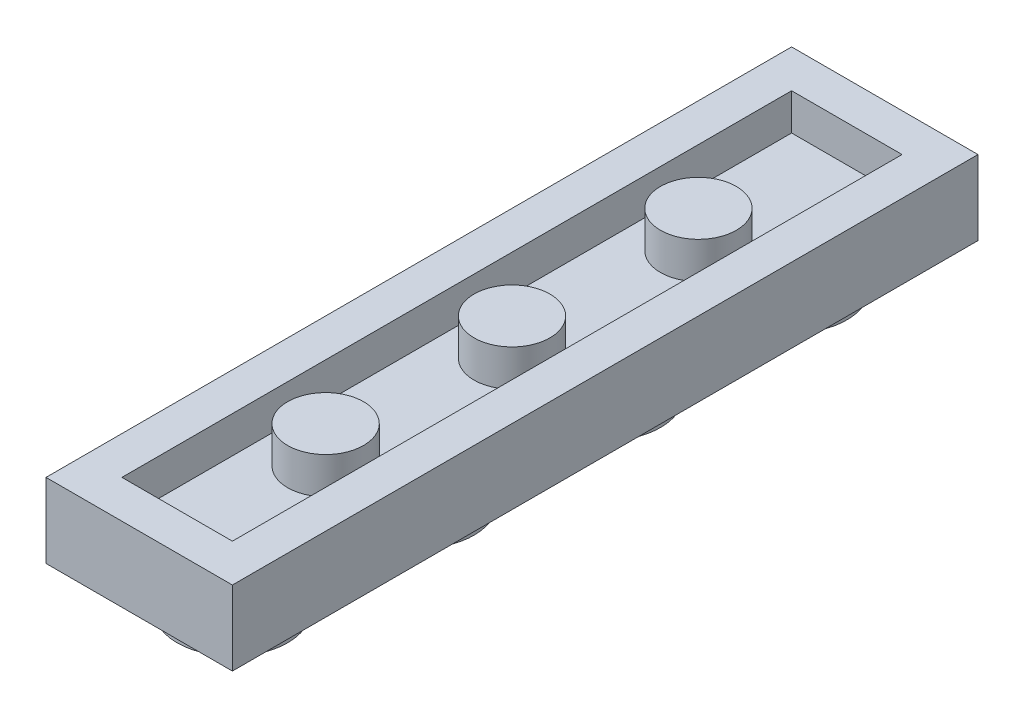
ISO-10303-21;
HEADER;
FILE_DESCRIPTION(('STEP AP214'),'2;1');
FILE_NAME('part.step','',(''),(''),'','','');
FILE_SCHEMA(('AUTOMOTIVE_DESIGN { 1 0 10303 214 1 1 1 1 }'));
ENDSEC;
DATA;
#1=APPLICATION_CONTEXT('core data for automotive mechanical design processes');
#2=APPLICATION_PROTOCOL_DEFINITION('international standard','automotive_design',2000,#1);
#3=PRODUCT_CONTEXT('',#1,'mechanical');
#4=PRODUCT('Part','Part','',(#3));
#5=PRODUCT_RELATED_PRODUCT_CATEGORY('part','',(#4));
#6=PRODUCT_DEFINITION_FORMATION('','',#4);
#7=PRODUCT_DEFINITION_CONTEXT('part definition',#1,'design');
#8=PRODUCT_DEFINITION('design','',#6,#7);
#9=PRODUCT_DEFINITION_SHAPE('','',#8);
#10=(LENGTH_UNIT() NAMED_UNIT(*) SI_UNIT(.MILLI.,.METRE.));
#11=(NAMED_UNIT(*) PLANE_ANGLE_UNIT() SI_UNIT($,.RADIAN.));
#12=(NAMED_UNIT(*) SI_UNIT($,.STERADIAN.) SOLID_ANGLE_UNIT());
#13=UNCERTAINTY_MEASURE_WITH_UNIT(LENGTH_MEASURE(1.E-05),#10,'distance_accuracy_value','');
#14=(GEOMETRIC_REPRESENTATION_CONTEXT(3) GLOBAL_UNCERTAINTY_ASSIGNED_CONTEXT((#13)) GLOBAL_UNIT_ASSIGNED_CONTEXT((#10,
#11,#12)) REPRESENTATION_CONTEXT('',''));
#15=CARTESIAN_POINT('',(0.,0.,0.));
#16=DIRECTION('',(0.,0.,1.));
#17=DIRECTION('',(1.,0.,0.));
#18=AXIS2_PLACEMENT_3D('',#15,#16,#17);
#19=CARTESIAN_POINT('',(1.711759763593,3.226,10.0958));
#20=DIRECTION('',(0.,1.,0.));
#21=DIRECTION('',(0.,0.,-1.));
#22=AXIS2_PLACEMENT_3D('',#19,#20,#21);
#23=PLANE('',#22);
#24=CARTESIAN_POINT('',(0.,3.22600000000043,8.065));
#25=DIRECTION('',(0.,1.,0.));
#26=DIRECTION('',(0.,0.,1.));
#27=AXIS2_PLACEMENT_3D('',#24,#25,#26);
#28=CIRCLE('',#27,1.6425);
#29=CARTESIAN_POINT('',(0.,3.22600000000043,9.7075));
#30=VERTEX_POINT('',#29);
#31=EDGE_CURVE('E20',#30,#30,#28,.T.);
#32=ORIENTED_EDGE('',*,*,#31,.T.);
#33=EDGE_LOOP('',(#32));
#34=FACE_BOUND('',#33,.T.);
#35=ADVANCED_FACE('F16',(#34),#23,.T.);
#36=CARTESIAN_POINT('',(1.711759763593,3.226,10.0958));
#37=DIRECTION('',(0.,1.,0.));
#38=DIRECTION('',(0.,0.,-1.));
#39=AXIS2_PLACEMENT_3D('',#36,#37,#38);
#40=PLANE('',#39);
#41=CARTESIAN_POINT('',(0.,3.22600000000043,0.));
#42=DIRECTION('',(0.,1.,0.));
#43=DIRECTION('',(0.,0.,1.));
#44=AXIS2_PLACEMENT_3D('',#41,#42,#43);
#45=CIRCLE('',#44,1.6425);
#46=CARTESIAN_POINT('',(0.,3.22600000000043,1.6425));
#47=VERTEX_POINT('',#46);
#48=EDGE_CURVE('E184',#47,#47,#45,.T.);
#49=ORIENTED_EDGE('',*,*,#48,.T.);
#50=EDGE_LOOP('',(#49));
#51=FACE_BOUND('',#50,.T.);
#52=ADVANCED_FACE('F368',(#51),#40,.T.);
#53=CARTESIAN_POINT('',(1.711759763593,3.226,10.0958));
#54=DIRECTION('',(0.,1.,0.));
#55=DIRECTION('',(0.,0.,-1.));
#56=AXIS2_PLACEMENT_3D('',#53,#54,#55);
#57=PLANE('',#56);
#58=CARTESIAN_POINT('',(0.,3.22600000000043,-8.065));
#59=DIRECTION('',(0.,1.,0.));
#60=DIRECTION('',(0.,0.,1.));
#61=AXIS2_PLACEMENT_3D('',#58,#59,#60);
#62=CIRCLE('',#61,1.6425);
#63=CARTESIAN_POINT('',(0.,3.22600000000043,-6.4225));
#64=VERTEX_POINT('',#63);
#65=EDGE_CURVE('E182',#64,#64,#62,.T.);
#66=ORIENTED_EDGE('',*,*,#65,.T.);
#67=EDGE_LOOP('',(#66));
#68=FACE_BOUND('',#67,.T.);
#69=ADVANCED_FACE('F196',(#68),#57,.T.);
#70=CARTESIAN_POINT('',(0.,1.6424999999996,8.065));
#71=DIRECTION('',(0.,1.,0.));
#72=DIRECTION('',(0.,0.,1.));
#73=AXIS2_PLACEMENT_3D('',#70,#71,#72);
#74=CYLINDRICAL_SURFACE('',#73,1.6425);
#75=ORIENTED_EDGE('',*,*,#31,.F.);
#76=EDGE_LOOP('',(#75));
#77=FACE_BOUND('',#76,.T.);
#78=CARTESIAN_POINT('',(0.,1.6424999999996,8.065));
#79=DIRECTION('',(0.,1.,0.));
#80=DIRECTION('',(0.,0.,1.));
#81=AXIS2_PLACEMENT_3D('',#78,#79,#80);
#82=CIRCLE('',#81,1.6425);
#83=CARTESIAN_POINT('',(0.,1.6424999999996,9.7075));
#84=VERTEX_POINT('',#83);
#85=EDGE_CURVE('E179',#84,#84,#82,.F.);
#86=ORIENTED_EDGE('',*,*,#85,.F.);
#87=EDGE_LOOP('',(#86));
#88=FACE_BOUND('',#87,.T.);
#89=ADVANCED_FACE('F192',(#77,#88),#74,.T.);
#90=CARTESIAN_POINT('',(0.,1.6424999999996,0.));
#91=DIRECTION('',(0.,1.,0.));
#92=DIRECTION('',(0.,0.,1.));
#93=AXIS2_PLACEMENT_3D('',#90,#91,#92);
#94=CYLINDRICAL_SURFACE('',#93,1.6425);
#95=ORIENTED_EDGE('',*,*,#48,.F.);
#96=EDGE_LOOP('',(#95));
#97=FACE_BOUND('',#96,.T.);
#98=CARTESIAN_POINT('',(0.,1.6424999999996,0.));
#99=DIRECTION('',(0.,1.,0.));
#100=DIRECTION('',(0.,0.,1.));
#101=AXIS2_PLACEMENT_3D('',#98,#99,#100);
#102=CIRCLE('',#101,1.6425);
#103=CARTESIAN_POINT('',(0.,1.6424999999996,1.6425));
#104=VERTEX_POINT('',#103);
#105=EDGE_CURVE('E176',#104,#104,#102,.F.);
#106=ORIENTED_EDGE('',*,*,#105,.F.);
#107=EDGE_LOOP('',(#106));
#108=FACE_BOUND('',#107,.T.);
#109=ADVANCED_FACE('F195',(#97,#108),#94,.T.);
#110=CARTESIAN_POINT('',(0.,1.6424999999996,-8.065));
#111=DIRECTION('',(0.,1.,0.));
#112=DIRECTION('',(0.,0.,1.));
#113=AXIS2_PLACEMENT_3D('',#110,#111,#112);
#114=CYLINDRICAL_SURFACE('',#113,1.6425);
#115=ORIENTED_EDGE('',*,*,#65,.F.);
#116=EDGE_LOOP('',(#115));
#117=FACE_BOUND('',#116,.T.);
#118=CARTESIAN_POINT('',(0.,1.6424999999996,-8.065));
#119=DIRECTION('',(0.,1.,0.));
#120=DIRECTION('',(0.,0.,1.));
#121=AXIS2_PLACEMENT_3D('',#118,#119,#120);
#122=CIRCLE('',#121,1.6425);
#123=CARTESIAN_POINT('',(0.,1.6424999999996,-6.4225));
#124=VERTEX_POINT('',#123);
#125=EDGE_CURVE('E101',#124,#124,#122,.F.);
#126=ORIENTED_EDGE('',*,*,#125,.F.);
#127=EDGE_LOOP('',(#126));
#128=FACE_BOUND('',#127,.T.);
#129=ADVANCED_FACE('F201',(#117,#128),#114,.T.);
#130=CARTESIAN_POINT('',(-2.4856,1.6425,15.067));
#131=DIRECTION('',(0.,1.,0.));
#132=DIRECTION('',(1.,0.,0.));
#133=AXIS2_PLACEMENT_3D('',#130,#131,#132);
#134=PLANE('',#133);
#135=ORIENTED_EDGE('',*,*,#125,.T.);
#136=EDGE_LOOP('',(#135));
#137=FACE_BOUND('',#136,.T.);
#138=ORIENTED_EDGE('',*,*,#105,.T.);
#139=EDGE_LOOP('',(#138));
#140=FACE_BOUND('',#139,.T.);
#141=ORIENTED_EDGE('',*,*,#85,.T.);
#142=EDGE_LOOP('',(#141));
#143=FACE_BOUND('',#142,.T.);
#144=DIRECTION('',(0.,0.,-1.));
#145=VECTOR('',#144,1.);
#146=CARTESIAN_POINT('',(2.39,1.6425,0.));
#147=LINE('',#146,#145);
#148=CARTESIAN_POINT('',(2.39,1.6425,14.4875));
#149=VERTEX_POINT('',#148);
#150=CARTESIAN_POINT('',(2.39,1.6425,-14.4875));
#151=VERTEX_POINT('',#150);
#152=EDGE_CURVE('E108',#149,#151,#147,.T.);
#153=ORIENTED_EDGE('',*,*,#152,.T.);
#154=DIRECTION('',(-1.,0.,0.));
#155=VECTOR('',#154,1.);
#156=CARTESIAN_POINT('',(0.,1.6425,-14.4875));
#157=LINE('',#156,#155);
#158=CARTESIAN_POINT('',(-2.39,1.6425,-14.4875));
#159=VERTEX_POINT('',#158);
#160=EDGE_CURVE('E100',#151,#159,#157,.T.);
#161=ORIENTED_EDGE('',*,*,#160,.T.);
#162=DIRECTION('',(0.,0.,1.));
#163=VECTOR('',#162,1.);
#164=CARTESIAN_POINT('',(-2.39,1.6425,0.));
#165=LINE('',#164,#163);
#166=CARTESIAN_POINT('',(-2.39,1.6425,14.4875));
#167=VERTEX_POINT('',#166);
#168=EDGE_CURVE('E89',#159,#167,#165,.T.);
#169=ORIENTED_EDGE('',*,*,#168,.T.);
#170=DIRECTION('',(1.,0.,0.));
#171=VECTOR('',#170,1.);
#172=CARTESIAN_POINT('',(0.,1.6425,14.4875));
#173=LINE('',#172,#171);
#174=EDGE_CURVE('E121',#167,#149,#173,.T.);
#175=ORIENTED_EDGE('',*,*,#174,.T.);
#176=EDGE_LOOP('',(#153,#161,#169,#175));
#177=FACE_BOUND('',#176,.T.);
#178=ADVANCED_FACE('F111',(#137,#140,#143,#177),#134,.T.);
#179=CARTESIAN_POINT('',(-2.39,1.602146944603,-15.067));
#180=DIRECTION('',(-1.,0.,0.));
#181=DIRECTION('',(0.,0.,1.));
#182=AXIS2_PLACEMENT_3D('',#179,#180,#181);
#183=PLANE('',#182);
#184=ORIENTED_EDGE('',*,*,#168,.F.);
#185=DIRECTION('',(0.,1.,0.));
#186=VECTOR('',#185,1.);
#187=CARTESIAN_POINT('',(-2.39,2.43425,-14.4875));
#188=LINE('',#187,#186);
#189=CARTESIAN_POINT('',(-2.39,3.226,-14.4875));
#190=VERTEX_POINT('',#189);
#191=EDGE_CURVE('E93',#159,#190,#188,.T.);
#192=ORIENTED_EDGE('',*,*,#191,.T.);
#193=DIRECTION('',(0.,0.,-1.));
#194=VECTOR('',#193,1.);
#195=CARTESIAN_POINT('',(-2.39,3.226,0.));
#196=LINE('',#195,#194);
#197=CARTESIAN_POINT('',(-2.39,3.226,14.4875));
#198=VERTEX_POINT('',#197);
#199=EDGE_CURVE('E120',#198,#190,#196,.T.);
#200=ORIENTED_EDGE('',*,*,#199,.F.);
#201=DIRECTION('',(0.,-1.,0.));
#202=VECTOR('',#201,1.);
#203=CARTESIAN_POINT('',(-2.39,2.43425,14.4875));
#204=LINE('',#203,#202);
#205=EDGE_CURVE('E95',#198,#167,#204,.T.);
#206=ORIENTED_EDGE('',*,*,#205,.T.);
#207=EDGE_LOOP('',(#184,#192,#200,#206));
#208=FACE_BOUND('',#207,.T.);
#209=ADVANCED_FACE('F91',(#208),#183,.F.);
#210=CARTESIAN_POINT('',(2.4856,1.602146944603,-14.4875));
#211=DIRECTION('',(0.,0.,-1.));
#212=DIRECTION('',(-1.,0.,0.));
#213=AXIS2_PLACEMENT_3D('',#210,#211,#212);
#214=PLANE('',#213);
#215=ORIENTED_EDGE('',*,*,#160,.F.);
#216=DIRECTION('',(0.,1.,0.));
#217=VECTOR('',#216,1.);
#218=CARTESIAN_POINT('',(2.39,2.43425,-14.4875));
#219=LINE('',#218,#217);
#220=CARTESIAN_POINT('',(2.39,3.226,-14.4875));
#221=VERTEX_POINT('',#220);
#222=EDGE_CURVE('E114',#151,#221,#219,.T.);
#223=ORIENTED_EDGE('',*,*,#222,.T.);
#224=DIRECTION('',(1.,0.,0.));
#225=VECTOR('',#224,1.);
#226=CARTESIAN_POINT('',(0.,3.226,-14.4875));
#227=LINE('',#226,#225);
#228=EDGE_CURVE('E107',#190,#221,#227,.T.);
#229=ORIENTED_EDGE('',*,*,#228,.F.);
#230=ORIENTED_EDGE('',*,*,#191,.F.);
#231=EDGE_LOOP('',(#215,#223,#229,#230));
#232=FACE_BOUND('',#231,.T.);
#233=ADVANCED_FACE('F104',(#232),#214,.F.);
#234=CARTESIAN_POINT('',(2.39,1.602146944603,15.067));
#235=DIRECTION('',(1.,0.,0.));
#236=DIRECTION('',(0.,0.,-1.));
#237=AXIS2_PLACEMENT_3D('',#234,#235,#236);
#238=PLANE('',#237);
#239=ORIENTED_EDGE('',*,*,#152,.F.);
#240=DIRECTION('',(0.,1.,0.));
#241=VECTOR('',#240,1.);
#242=CARTESIAN_POINT('',(2.39,2.43425,14.4875));
#243=LINE('',#242,#241);
#244=CARTESIAN_POINT('',(2.39,3.226,14.4875));
#245=VERTEX_POINT('',#244);
#246=EDGE_CURVE('E117',#149,#245,#243,.T.);
#247=ORIENTED_EDGE('',*,*,#246,.T.);
#248=DIRECTION('',(0.,0.,1.));
#249=VECTOR('',#248,1.);
#250=CARTESIAN_POINT('',(2.39,3.226,0.));
#251=LINE('',#250,#249);
#252=EDGE_CURVE('E128',#221,#245,#251,.T.);
#253=ORIENTED_EDGE('',*,*,#252,.F.);
#254=ORIENTED_EDGE('',*,*,#222,.F.);
#255=EDGE_LOOP('',(#239,#247,#253,#254));
#256=FACE_BOUND('',#255,.T.);
#257=ADVANCED_FACE('F280',(#256),#238,.F.);
#258=CARTESIAN_POINT('',(-2.4856,1.602146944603,14.4875));
#259=DIRECTION('',(0.,0.,1.));
#260=DIRECTION('',(1.,0.,0.));
#261=AXIS2_PLACEMENT_3D('',#258,#259,#260);
#262=PLANE('',#261);
#263=ORIENTED_EDGE('',*,*,#174,.F.);
#264=ORIENTED_EDGE('',*,*,#205,.F.);
#265=DIRECTION('',(-1.,0.,0.));
#266=VECTOR('',#265,1.);
#267=CARTESIAN_POINT('',(0.,3.226,14.4875));
#268=LINE('',#267,#266);
#269=EDGE_CURVE('E124',#245,#198,#268,.T.);
#270=ORIENTED_EDGE('',*,*,#269,.F.);
#271=ORIENTED_EDGE('',*,*,#246,.F.);
#272=EDGE_LOOP('',(#263,#264,#270,#271));
#273=FACE_BOUND('',#272,.T.);
#274=ADVANCED_FACE('F276',(#273),#262,.F.);
#275=CARTESIAN_POINT('',(-4.1938,3.226,16.7752));
#276=DIRECTION('',(0.,1.,0.));
#277=DIRECTION('',(1.,0.,0.));
#278=AXIS2_PLACEMENT_3D('',#275,#276,#277);
#279=PLANE('',#278);
#280=ORIENTED_EDGE('',*,*,#252,.T.);
#281=ORIENTED_EDGE('',*,*,#269,.T.);
#282=ORIENTED_EDGE('',*,*,#199,.T.);
#283=ORIENTED_EDGE('',*,*,#228,.T.);
#284=EDGE_LOOP('',(#280,#281,#282,#283));
#285=FACE_BOUND('',#284,.T.);
#286=DIRECTION('',(0.,0.,1.));
#287=VECTOR('',#286,1.);
#288=CARTESIAN_POINT('',(4.0325,3.226,0.));
#289=LINE('',#288,#287);
#290=CARTESIAN_POINT('',(4.0325,3.226,-16.13));
#291=VERTEX_POINT('',#290);
#292=CARTESIAN_POINT('',(4.0325,3.226,16.13));
#293=VERTEX_POINT('',#292);
#294=EDGE_CURVE('E136',#291,#293,#289,.T.);
#295=ORIENTED_EDGE('',*,*,#294,.F.);
#296=DIRECTION('',(1.,0.,0.));
#297=VECTOR('',#296,1.);
#298=CARTESIAN_POINT('',(0.,3.226,-16.13));
#299=LINE('',#298,#297);
#300=CARTESIAN_POINT('',(-4.0325,3.226,-16.13));
#301=VERTEX_POINT('',#300);
#302=EDGE_CURVE('E53',#301,#291,#299,.T.);
#303=ORIENTED_EDGE('',*,*,#302,.F.);
#304=DIRECTION('',(0.,0.,-1.));
#305=VECTOR('',#304,1.);
#306=CARTESIAN_POINT('',(-4.0325,3.226,0.));
#307=LINE('',#306,#305);
#308=CARTESIAN_POINT('',(-4.0325,3.226,16.13));
#309=VERTEX_POINT('',#308);
#310=EDGE_CURVE('E127',#309,#301,#307,.T.);
#311=ORIENTED_EDGE('',*,*,#310,.F.);
#312=DIRECTION('',(-1.,0.,0.));
#313=VECTOR('',#312,1.);
#314=CARTESIAN_POINT('',(0.,3.226,16.13));
#315=LINE('',#314,#313);
#316=EDGE_CURVE('E133',#293,#309,#315,.T.);
#317=ORIENTED_EDGE('',*,*,#316,.F.);
#318=EDGE_LOOP('',(#295,#303,#311,#317));
#319=FACE_BOUND('',#318,.T.);
#320=ADVANCED_FACE('F272',(#285,#319),#279,.T.);
#321=CARTESIAN_POINT('',(-2.4856,-1.78,-9.607960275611));
#322=DIRECTION('',(0.,1.,0.));
#323=DIRECTION('',(1.,0.,0.));
#324=AXIS2_PLACEMENT_3D('',#321,#322,#323);
#325=PLANE('',#324);
#326=CARTESIAN_POINT('',(0.,-1.78000000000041,-12.0975));
#327=DIRECTION('',(0.,1.,0.));
#328=DIRECTION('',(0.,0.,1.));
#329=AXIS2_PLACEMENT_3D('',#326,#327,#328);
#330=CIRCLE('',#329,2.39);
#331=CARTESIAN_POINT('',(0.,-1.78000000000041,-9.7075));
#332=VERTEX_POINT('',#331);
#333=EDGE_CURVE('E143',#332,#332,#330,.F.);
#334=ORIENTED_EDGE('',*,*,#333,.T.);
#335=EDGE_LOOP('',(#334));
#336=FACE_BOUND('',#335,.T.);
#337=ADVANCED_FACE('F268',(#336),#325,.F.);
#338=CARTESIAN_POINT('',(-2.4856,-1.78,-1.542960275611));
#339=DIRECTION('',(0.,1.,0.));
#340=DIRECTION('',(1.,0.,0.));
#341=AXIS2_PLACEMENT_3D('',#338,#339,#340);
#342=PLANE('',#341);
#343=CARTESIAN_POINT('',(0.,-1.78000000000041,-4.0325));
#344=DIRECTION('',(0.,1.,0.));
#345=DIRECTION('',(0.,0.,1.));
#346=AXIS2_PLACEMENT_3D('',#343,#344,#345);
#347=CIRCLE('',#346,2.39);
#348=CARTESIAN_POINT('',(0.,-1.78000000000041,-1.6425));
#349=VERTEX_POINT('',#348);
#350=EDGE_CURVE('E169',#349,#349,#347,.F.);
#351=ORIENTED_EDGE('',*,*,#350,.T.);
#352=EDGE_LOOP('',(#351));
#353=FACE_BOUND('',#352,.T.);
#354=ADVANCED_FACE('F264',(#353),#342,.F.);
#355=CARTESIAN_POINT('',(-2.4856,-1.78,6.522039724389));
#356=DIRECTION('',(0.,1.,0.));
#357=DIRECTION('',(1.,0.,0.));
#358=AXIS2_PLACEMENT_3D('',#355,#356,#357);
#359=PLANE('',#358);
#360=CARTESIAN_POINT('',(0.,-1.78000000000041,4.0325));
#361=DIRECTION('',(0.,1.,0.));
#362=DIRECTION('',(0.,0.,1.));
#363=AXIS2_PLACEMENT_3D('',#360,#361,#362);
#364=CIRCLE('',#363,2.39);
#365=CARTESIAN_POINT('',(0.,-1.78000000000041,6.4225));
#366=VERTEX_POINT('',#365);
#367=EDGE_CURVE('E166',#366,#366,#364,.F.);
#368=ORIENTED_EDGE('',*,*,#367,.T.);
#369=EDGE_LOOP('',(#368));
#370=FACE_BOUND('',#369,.T.);
#371=ADVANCED_FACE('F260',(#370),#359,.F.);
#372=CARTESIAN_POINT('',(-2.4856,-1.78,14.58703972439));
#373=DIRECTION('',(0.,1.,0.));
#374=DIRECTION('',(1.,0.,0.));
#375=AXIS2_PLACEMENT_3D('',#372,#373,#374);
#376=PLANE('',#375);
#377=CARTESIAN_POINT('',(0.,-1.78000000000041,12.0975));
#378=DIRECTION('',(0.,1.,0.));
#379=DIRECTION('',(0.,0.,1.));
#380=AXIS2_PLACEMENT_3D('',#377,#378,#379);
#381=CIRCLE('',#380,2.39);
#382=CARTESIAN_POINT('',(0.,-1.78000000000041,14.4875));
#383=VERTEX_POINT('',#382);
#384=EDGE_CURVE('E155',#383,#383,#381,.F.);
#385=ORIENTED_EDGE('',*,*,#384,.T.);
#386=EDGE_LOOP('',(#385));
#387=FACE_BOUND('',#386,.T.);
#388=ADVANCED_FACE('F257',(#387),#376,.F.);
#389=CARTESIAN_POINT('',(-4.0325,-0.06452,-16.7752));
#390=DIRECTION('',(-1.,0.,0.));
#391=DIRECTION('',(0.,0.,1.));
#392=AXIS2_PLACEMENT_3D('',#389,#390,#391);
#393=PLANE('',#392);
#394=ORIENTED_EDGE('',*,*,#310,.T.);
#395=DIRECTION('',(0.,1.,0.));
#396=VECTOR('',#395,1.);
#397=CARTESIAN_POINT('',(-4.0325,1.613,-16.13));
#398=LINE('',#397,#396);
#399=CARTESIAN_POINT('',(-4.0325,0.,-16.13));
#400=VERTEX_POINT('',#399);
#401=EDGE_CURVE('E140',#400,#301,#398,.T.);
#402=ORIENTED_EDGE('',*,*,#401,.F.);
#403=DIRECTION('',(0.,0.,1.));
#404=VECTOR('',#403,1.);
#405=CARTESIAN_POINT('',(-4.0325,0.,0.));
#406=LINE('',#405,#404);
#407=CARTESIAN_POINT('',(-4.0325,0.,16.13));
#408=VERTEX_POINT('',#407);
#409=EDGE_CURVE('E48',#400,#408,#406,.T.);
#410=ORIENTED_EDGE('',*,*,#409,.T.);
#411=DIRECTION('',(0.,-1.,0.));
#412=VECTOR('',#411,1.);
#413=CARTESIAN_POINT('',(-4.0325,1.613,16.13));
#414=LINE('',#413,#412);
#415=EDGE_CURVE('E134',#309,#408,#414,.T.);
#416=ORIENTED_EDGE('',*,*,#415,.F.);
#417=EDGE_LOOP('',(#394,#402,#410,#416));
#418=FACE_BOUND('',#417,.T.);
#419=ADVANCED_FACE('F239',(#418),#393,.T.);
#420=CARTESIAN_POINT('',(-4.1938,-0.06452,16.13));
#421=DIRECTION('',(0.,0.,1.));
#422=DIRECTION('',(1.,0.,0.));
#423=AXIS2_PLACEMENT_3D('',#420,#421,#422);
#424=PLANE('',#423);
#425=ORIENTED_EDGE('',*,*,#316,.T.);
#426=ORIENTED_EDGE('',*,*,#415,.T.);
#427=DIRECTION('',(1.,0.,0.));
#428=VECTOR('',#427,1.);
#429=CARTESIAN_POINT('',(0.,0.,16.13));
#430=LINE('',#429,#428);
#431=CARTESIAN_POINT('',(4.0325,0.,16.13));
#432=VERTEX_POINT('',#431);
#433=EDGE_CURVE('E152',#408,#432,#430,.T.);
#434=ORIENTED_EDGE('',*,*,#433,.T.);
#435=DIRECTION('',(0.,-1.,0.));
#436=VECTOR('',#435,1.);
#437=CARTESIAN_POINT('',(4.0325,1.613,16.13));
#438=LINE('',#437,#436);
#439=EDGE_CURVE('E138',#293,#432,#438,.T.);
#440=ORIENTED_EDGE('',*,*,#439,.F.);
#441=EDGE_LOOP('',(#425,#426,#434,#440));
#442=FACE_BOUND('',#441,.T.);
#443=ADVANCED_FACE('F234',(#442),#424,.T.);
#444=CARTESIAN_POINT('',(4.0325,-0.06452,16.7752));
#445=DIRECTION('',(1.,0.,0.));
#446=DIRECTION('',(0.,0.,-1.));
#447=AXIS2_PLACEMENT_3D('',#444,#445,#446);
#448=PLANE('',#447);
#449=ORIENTED_EDGE('',*,*,#294,.T.);
#450=ORIENTED_EDGE('',*,*,#439,.T.);
#451=DIRECTION('',(0.,0.,-1.));
#452=VECTOR('',#451,1.);
#453=CARTESIAN_POINT('',(4.0325,0.,0.));
#454=LINE('',#453,#452);
#455=CARTESIAN_POINT('',(4.0325,0.,-16.13));
#456=VERTEX_POINT('',#455);
#457=EDGE_CURVE('E149',#432,#456,#454,.T.);
#458=ORIENTED_EDGE('',*,*,#457,.T.);
#459=DIRECTION('',(0.,-1.,0.));
#460=VECTOR('',#459,1.);
#461=CARTESIAN_POINT('',(4.0325,1.613,-16.13));
#462=LINE('',#461,#460);
#463=EDGE_CURVE('E35',#291,#456,#462,.T.);
#464=ORIENTED_EDGE('',*,*,#463,.F.);
#465=EDGE_LOOP('',(#449,#450,#458,#464));
#466=FACE_BOUND('',#465,.T.);
#467=ADVANCED_FACE('F243',(#466),#448,.T.);
#468=CARTESIAN_POINT('',(4.1938,-0.06452,-16.13));
#469=DIRECTION('',(0.,0.,-1.));
#470=DIRECTION('',(-1.,0.,0.));
#471=AXIS2_PLACEMENT_3D('',#468,#469,#470);
#472=PLANE('',#471);
#473=ORIENTED_EDGE('',*,*,#302,.T.);
#474=ORIENTED_EDGE('',*,*,#463,.T.);
#475=DIRECTION('',(-1.,0.,0.));
#476=VECTOR('',#475,1.);
#477=CARTESIAN_POINT('',(0.,0.,-16.13));
#478=LINE('',#477,#476);
#479=EDGE_CURVE('E146',#456,#400,#478,.T.);
#480=ORIENTED_EDGE('',*,*,#479,.T.);
#481=ORIENTED_EDGE('',*,*,#401,.T.);
#482=EDGE_LOOP('',(#473,#474,#480,#481));
#483=FACE_BOUND('',#482,.T.);
#484=ADVANCED_FACE('F240',(#483),#472,.T.);
#485=CARTESIAN_POINT('',(0.,-1.78000000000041,-12.0975));
#486=DIRECTION('',(0.,1.,0.));
#487=DIRECTION('',(0.,0.,1.));
#488=AXIS2_PLACEMENT_3D('',#485,#486,#487);
#489=CYLINDRICAL_SURFACE('',#488,2.39);
#490=ORIENTED_EDGE('',*,*,#333,.F.);
#491=EDGE_LOOP('',(#490));
#492=FACE_BOUND('',#491,.T.);
#493=CARTESIAN_POINT('',(0.,0.,-12.0975));
#494=DIRECTION('',(0.,1.,0.));
#495=DIRECTION('',(0.,0.,1.));
#496=AXIS2_PLACEMENT_3D('',#493,#494,#495);
#497=CIRCLE('',#496,2.39);
#498=CARTESIAN_POINT('',(0.,0.,-9.7075));
#499=VERTEX_POINT('',#498);
#500=EDGE_CURVE('E148',#499,#499,#497,.F.);
#501=ORIENTED_EDGE('',*,*,#500,.T.);
#502=EDGE_LOOP('',(#501));
#503=FACE_BOUND('',#502,.T.);
#504=ADVANCED_FACE('F242',(#492,#503),#489,.T.);
#505=CARTESIAN_POINT('',(0.,-1.78000000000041,-4.0325));
#506=DIRECTION('',(0.,1.,0.));
#507=DIRECTION('',(0.,0.,1.));
#508=AXIS2_PLACEMENT_3D('',#505,#506,#507);
#509=CYLINDRICAL_SURFACE('',#508,2.39);
#510=ORIENTED_EDGE('',*,*,#350,.F.);
#511=EDGE_LOOP('',(#510));
#512=FACE_BOUND('',#511,.T.);
#513=CARTESIAN_POINT('',(0.,0.,-4.0325));
#514=DIRECTION('',(0.,1.,0.));
#515=DIRECTION('',(0.,0.,1.));
#516=AXIS2_PLACEMENT_3D('',#513,#514,#515);
#517=CIRCLE('',#516,2.39);
#518=CARTESIAN_POINT('',(0.,0.,-1.6425));
#519=VERTEX_POINT('',#518);
#520=EDGE_CURVE('E159',#519,#519,#517,.F.);
#521=ORIENTED_EDGE('',*,*,#520,.T.);
#522=EDGE_LOOP('',(#521));
#523=FACE_BOUND('',#522,.T.);
#524=ADVANCED_FACE('F248',(#512,#523),#509,.T.);
#525=CARTESIAN_POINT('',(0.,-1.78000000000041,4.0325));
#526=DIRECTION('',(0.,1.,0.));
#527=DIRECTION('',(0.,0.,1.));
#528=AXIS2_PLACEMENT_3D('',#525,#526,#527);
#529=CYLINDRICAL_SURFACE('',#528,2.39);
#530=ORIENTED_EDGE('',*,*,#367,.F.);
#531=EDGE_LOOP('',(#530));
#532=FACE_BOUND('',#531,.T.);
#533=CARTESIAN_POINT('',(0.,0.,4.0325));
#534=DIRECTION('',(0.,1.,0.));
#535=DIRECTION('',(0.,0.,1.));
#536=AXIS2_PLACEMENT_3D('',#533,#534,#535);
#537=CIRCLE('',#536,2.39);
#538=CARTESIAN_POINT('',(0.,0.,6.4225));
#539=VERTEX_POINT('',#538);
#540=EDGE_CURVE('E26',#539,#539,#537,.F.);
#541=ORIENTED_EDGE('',*,*,#540,.T.);
#542=EDGE_LOOP('',(#541));
#543=FACE_BOUND('',#542,.T.);
#544=ADVANCED_FACE('F220',(#532,#543),#529,.T.);
#545=CARTESIAN_POINT('',(0.,-1.78000000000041,12.0975));
#546=DIRECTION('',(0.,1.,0.));
#547=DIRECTION('',(0.,0.,1.));
#548=AXIS2_PLACEMENT_3D('',#545,#546,#547);
#549=CYLINDRICAL_SURFACE('',#548,2.39);
#550=ORIENTED_EDGE('',*,*,#384,.F.);
#551=EDGE_LOOP('',(#550));
#552=FACE_BOUND('',#551,.T.);
#553=CARTESIAN_POINT('',(0.,0.,12.0975));
#554=DIRECTION('',(0.,1.,0.));
#555=DIRECTION('',(0.,0.,1.));
#556=AXIS2_PLACEMENT_3D('',#553,#554,#555);
#557=CIRCLE('',#556,2.39);
#558=CARTESIAN_POINT('',(0.,0.,14.4875));
#559=VERTEX_POINT('',#558);
#560=EDGE_CURVE('E10',#559,#559,#557,.F.);
#561=ORIENTED_EDGE('',*,*,#560,.T.);
#562=EDGE_LOOP('',(#561));
#563=FACE_BOUND('',#562,.T.);
#564=ADVANCED_FACE('F215',(#552,#563),#549,.T.);
#565=CARTESIAN_POINT('',(-4.1938,0.,16.7752));
#566=DIRECTION('',(0.,1.,0.));
#567=DIRECTION('',(1.,0.,0.));
#568=AXIS2_PLACEMENT_3D('',#565,#566,#567);
#569=PLANE('',#568);
#570=ORIENTED_EDGE('',*,*,#560,.F.);
#571=EDGE_LOOP('',(#570));
#572=FACE_BOUND('',#571,.T.);
#573=ORIENTED_EDGE('',*,*,#540,.F.);
#574=EDGE_LOOP('',(#573));
#575=FACE_BOUND('',#574,.T.);
#576=ORIENTED_EDGE('',*,*,#520,.F.);
#577=EDGE_LOOP('',(#576));
#578=FACE_BOUND('',#577,.T.);
#579=ORIENTED_EDGE('',*,*,#500,.F.);
#580=EDGE_LOOP('',(#579));
#581=FACE_BOUND('',#580,.T.);
#582=ORIENTED_EDGE('',*,*,#457,.F.);
#583=ORIENTED_EDGE('',*,*,#433,.F.);
#584=ORIENTED_EDGE('',*,*,#409,.F.);
#585=ORIENTED_EDGE('',*,*,#479,.F.);
#586=EDGE_LOOP('',(#582,#583,#584,#585));
#587=FACE_BOUND('',#586,.T.);
#588=ADVANCED_FACE('F18',(#572,#575,#578,#581,#587),#569,.F.);
#589=CLOSED_SHELL('',(#35,#52,#69,#89,#109,#129,#178,#209,#233,#257,#274,#320,#337,#354,#371,
#388,#419,#443,#467,#484,#504,#524,#544,#564,#588));
#590=MANIFOLD_SOLID_BREP('B1',#589);
#591=ADVANCED_BREP_SHAPE_REPRESENTATION('',(#18,#590),#14);
#592=SHAPE_DEFINITION_REPRESENTATION(#9,#591);
ENDSEC;
END-ISO-10303-21;
